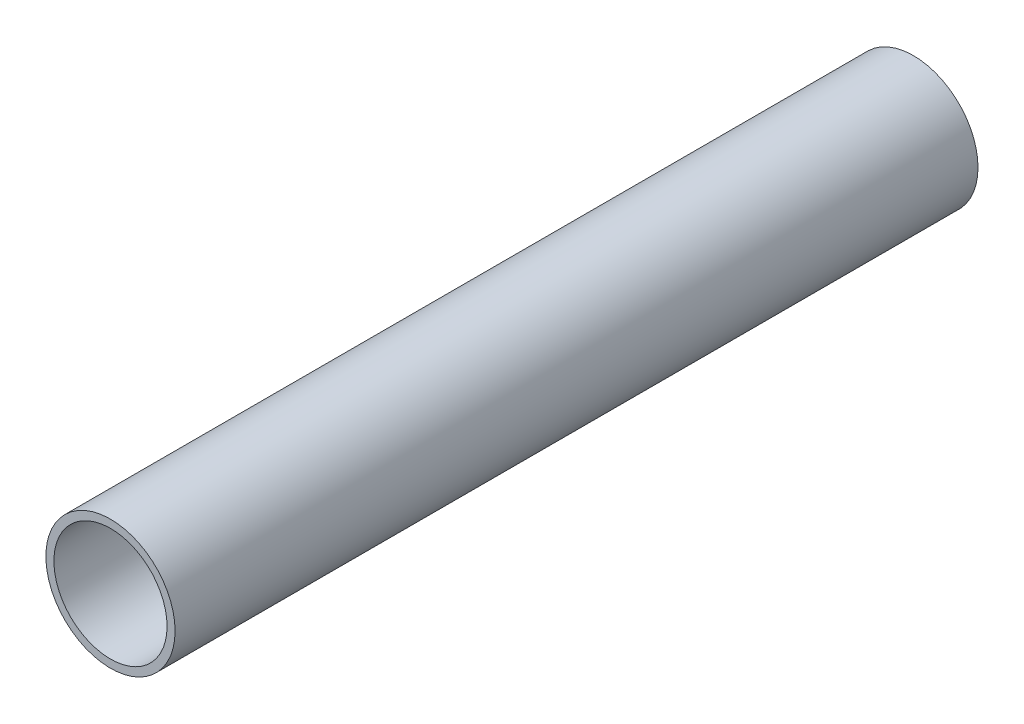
from build123d import *

# Parameters (mm, degrees)
SKETCH1_R      = 44.45
SKETCH1_R_2    = 38.9382
EXTRUDE1_DEPTH = 276.225


with BuildPart() as part:
    # Sketch1 → Extrude1 (new, symmetric)
    with BuildSketch(Plane.XY):
        Circle(SKETCH1_R)
        Circle(SKETCH1_R_2, mode=Mode.SUBTRACT)
    extrude(amount=EXTRUDE1_DEPTH, both=True)


solid = part.part
